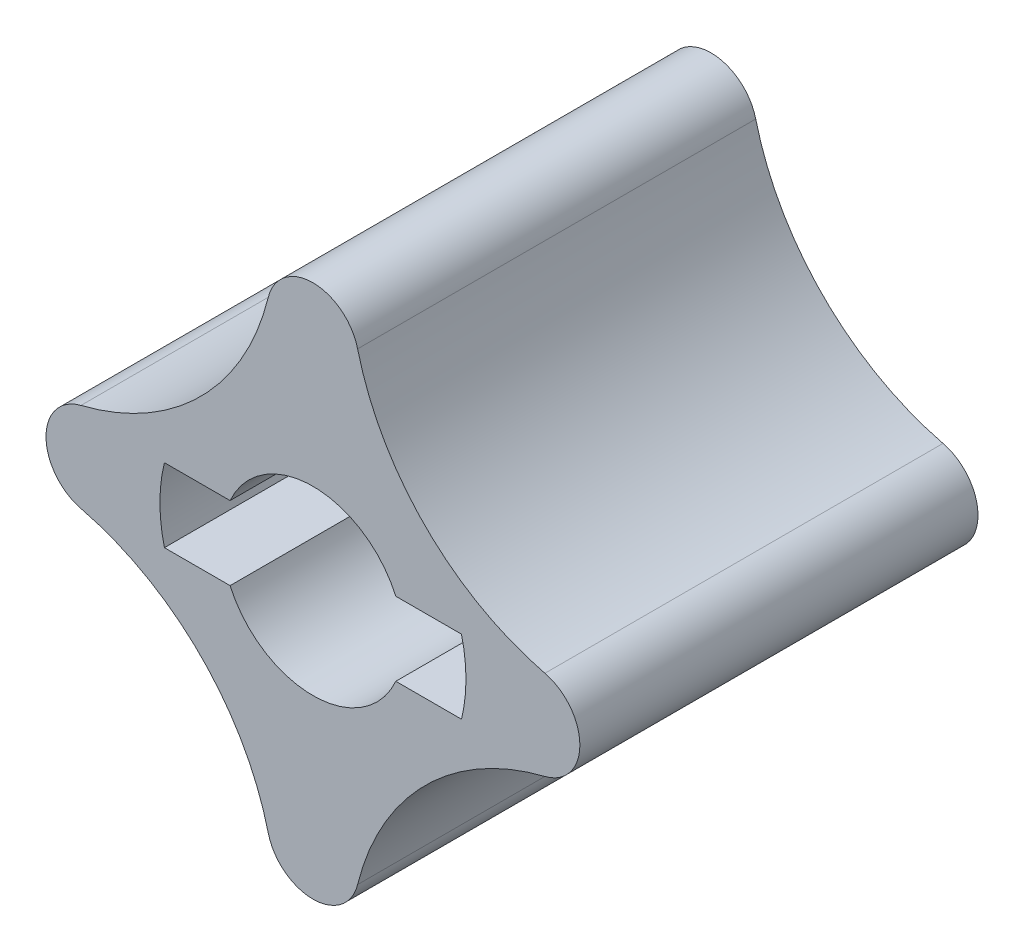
from build123d import *

# Parameters (mm, degrees)
SKETCH1_R          = 5.0038
BASE_EXTRUDE_DEPTH = 21.971
CUT_EXTRUDE1_DEPTH = 15.113


with BuildPart() as part:
    # Sketch1 → Base-Extrude (new body)
    with BuildSketch(Plane.XY):
        with BuildLine():
            ThreePointArc((2.465672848, 12.801965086), (0, 14.732), (-2.465672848, 12.801965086))
            ThreePointArc((-2.465672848, 12.801965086), (-6.195465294, 6.195465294), (-12.801965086, 2.465672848))
            ThreePointArc((-12.801965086, 2.465672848), (-14.732, 0), (-12.801965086, -2.465672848))
            ThreePointArc((-12.801965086, -2.465672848), (-6.195465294, -6.195465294), (-2.465672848, -12.801965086))
            ThreePointArc((-2.465672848, -12.801965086), (0, -14.732), (2.465672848, -12.801965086))
            ThreePointArc((2.465672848, -12.801965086), (6.195465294, -6.195465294), (12.801965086, -2.465672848))
            ThreePointArc((12.801965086, -2.465672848), (14.732, 0), (12.801965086, 2.465672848))
            ThreePointArc((12.801965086, 2.465672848), (6.195465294, 6.195465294), (2.465672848, 12.801965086))
        make_face()
        with Locations(Location((0, 0, 0), (0, 0, 180))):
            Circle(SKETCH1_R, mode=Mode.SUBTRACT)
    extrude(amount=BASE_EXTRUDE_DEPTH)

    # Sketch2 → Cut-Extrude1 (cut)
    with BuildSketch(Plane.XY.offset(21.971)):
        with BuildLine():
            Line((-8.197404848, 2.032), (8.197404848, 2.032))
            ThreePointArc((8.197404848, 2.032), (8.4455, 0), (8.197404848, -2.032))
            Line((8.197404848, -2.032), (-8.197404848, -2.032))
            ThreePointArc((-8.197404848, -2.032), (-8.4455, 0), (-8.197404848, 2.032))
        make_face()
    extrude(amount=-CUT_EXTRUDE1_DEPTH, mode=Mode.SUBTRACT)


solid = part.part
